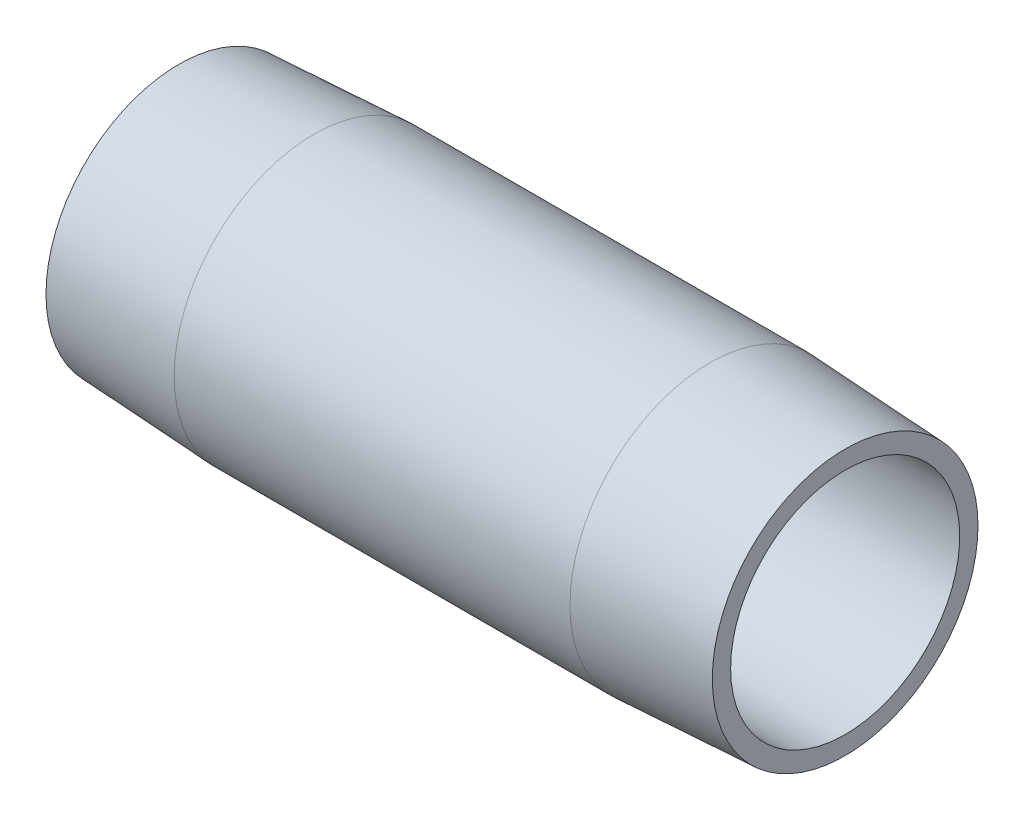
from build123d import *


with BuildPart() as part:
    # Sketch1 → Revolve1 (revolve)
    with BuildSketch(Plane.XY, mode=Mode.PRIVATE) as revolve1_sk:
        Polygon((50.8, 8.73125), (0, 8.73125), (0, 10.127550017), (10.3124, 10.668), (40.4876, 10.668), (50.8, 10.127550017), align=None)
    revolve(revolve1_sk.sketch.rotate(Axis((0, 0, 0), (1, 0, 0)), 90), axis=Axis((0, 0, 0), (1, 0, 0)))


solid = part.part
